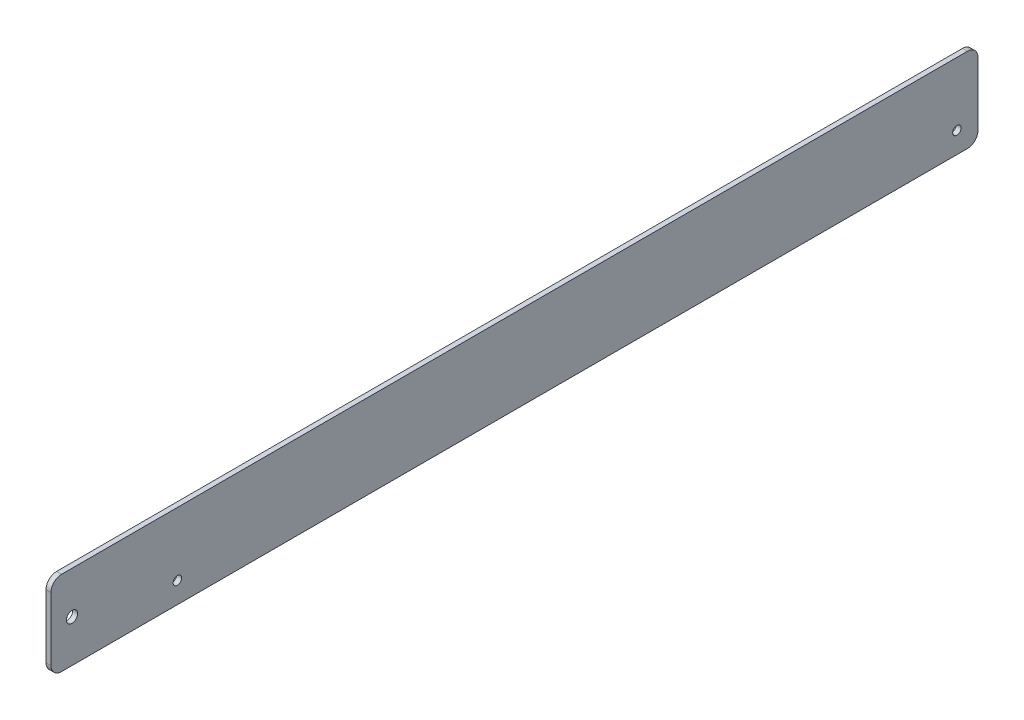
ISO-10303-21;
HEADER;
FILE_DESCRIPTION(('STEP AP214'),'2;1');
FILE_NAME('part.step','',(''),(''),'','','');
FILE_SCHEMA(('AUTOMOTIVE_DESIGN { 1 0 10303 214 1 1 1 1 }'));
ENDSEC;
DATA;
#1=APPLICATION_CONTEXT('core data for automotive mechanical design processes');
#2=APPLICATION_PROTOCOL_DEFINITION('international standard','automotive_design',2000,#1);
#3=PRODUCT_CONTEXT('',#1,'mechanical');
#4=PRODUCT('Part','Part','',(#3));
#5=PRODUCT_RELATED_PRODUCT_CATEGORY('part','',(#4));
#6=PRODUCT_DEFINITION_FORMATION('','',#4);
#7=PRODUCT_DEFINITION_CONTEXT('part definition',#1,'design');
#8=PRODUCT_DEFINITION('design','',#6,#7);
#9=PRODUCT_DEFINITION_SHAPE('','',#8);
#10=(LENGTH_UNIT() NAMED_UNIT(*) SI_UNIT(.MILLI.,.METRE.));
#11=(NAMED_UNIT(*) PLANE_ANGLE_UNIT() SI_UNIT($,.RADIAN.));
#12=(NAMED_UNIT(*) SI_UNIT($,.STERADIAN.) SOLID_ANGLE_UNIT());
#13=UNCERTAINTY_MEASURE_WITH_UNIT(LENGTH_MEASURE(1.E-05),#10,'distance_accuracy_value','');
#14=(GEOMETRIC_REPRESENTATION_CONTEXT(3) GLOBAL_UNCERTAINTY_ASSIGNED_CONTEXT((#13)) GLOBAL_UNIT_ASSIGNED_CONTEXT((#10,
#11,#12)) REPRESENTATION_CONTEXT('',''));
#15=CARTESIAN_POINT('',(0.,0.,0.));
#16=DIRECTION('',(0.,0.,1.));
#17=DIRECTION('',(1.,0.,0.));
#18=AXIS2_PLACEMENT_3D('',#15,#16,#17);
#19=CARTESIAN_POINT('',(2.9972,25.4,-279.4));
#20=DIRECTION('',(0.,0.,1.));
#21=DIRECTION('',(1.,0.,0.));
#22=AXIS2_PLACEMENT_3D('',#19,#20,#21);
#23=PLANE('',#22);
#24=DIRECTION('',(0.,1.,0.));
#25=VECTOR('',#24,1.);
#26=CARTESIAN_POINT('',(2.9972,25.4,-279.4));
#27=LINE('',#26,#25);
#28=CARTESIAN_POINT('',(2.9972,-19.05,-279.4));
#29=VERTEX_POINT('',#28);
#30=CARTESIAN_POINT('',(2.9972,19.05,-279.4));
#31=VERTEX_POINT('',#30);
#32=EDGE_CURVE('E234',#29,#31,#27,.T.);
#33=ORIENTED_EDGE('',*,*,#32,.F.);
#34=DIRECTION('',(-1.,0.,0.));
#35=VECTOR('',#34,1.);
#36=CARTESIAN_POINT('',(2.9972,-19.05,-279.4));
#37=LINE('',#36,#35);
#38=CARTESIAN_POINT('',(0.,-19.05,-279.4));
#39=VERTEX_POINT('',#38);
#40=EDGE_CURVE('E218',#29,#39,#37,.T.);
#41=ORIENTED_EDGE('',*,*,#40,.T.);
#42=DIRECTION('',(0.,1.,0.));
#43=VECTOR('',#42,1.);
#44=CARTESIAN_POINT('',(0.,25.4,-279.4));
#45=LINE('',#44,#43);
#46=CARTESIAN_POINT('',(0.,19.05,-279.4));
#47=VERTEX_POINT('',#46);
#48=EDGE_CURVE('E231',#39,#47,#45,.T.);
#49=ORIENTED_EDGE('',*,*,#48,.T.);
#50=DIRECTION('',(-1.,0.,0.));
#51=VECTOR('',#50,1.);
#52=CARTESIAN_POINT('',(2.9972,19.05,-279.4));
#53=LINE('',#52,#51);
#54=EDGE_CURVE('E237',#47,#31,#53,.F.);
#55=ORIENTED_EDGE('',*,*,#54,.T.);
#56=EDGE_LOOP('',(#33,#41,#49,#55));
#57=FACE_BOUND('',#56,.T.);
#58=ADVANCED_FACE('F148',(#57),#23,.F.);
#59=CARTESIAN_POINT('',(2.9972,25.4,279.4));
#60=DIRECTION('',(0.,-1.,0.));
#61=DIRECTION('',(0.,0.,-1.));
#62=AXIS2_PLACEMENT_3D('',#59,#60,#61);
#63=PLANE('',#62);
#64=DIRECTION('',(0.,0.,1.));
#65=VECTOR('',#64,1.);
#66=CARTESIAN_POINT('',(2.9972,25.4,279.4));
#67=LINE('',#66,#65);
#68=CARTESIAN_POINT('',(2.9972,25.4,-273.05));
#69=VERTEX_POINT('',#68);
#70=CARTESIAN_POINT('',(2.9972,25.4,273.05));
#71=VERTEX_POINT('',#70);
#72=EDGE_CURVE('E313',#69,#71,#67,.T.);
#73=ORIENTED_EDGE('',*,*,#72,.F.);
#74=DIRECTION('',(-1.,0.,0.));
#75=VECTOR('',#74,1.);
#76=CARTESIAN_POINT('',(2.9972,25.4,-273.05));
#77=LINE('',#76,#75);
#78=CARTESIAN_POINT('',(0.,25.4,-273.05));
#79=VERTEX_POINT('',#78);
#80=EDGE_CURVE('E291',#69,#79,#77,.T.);
#81=ORIENTED_EDGE('',*,*,#80,.T.);
#82=DIRECTION('',(0.,0.,1.));
#83=VECTOR('',#82,1.);
#84=CARTESIAN_POINT('',(0.,25.4,279.4));
#85=LINE('',#84,#83);
#86=CARTESIAN_POINT('',(0.,25.4,273.05));
#87=VERTEX_POINT('',#86);
#88=EDGE_CURVE('E242',#79,#87,#85,.T.);
#89=ORIENTED_EDGE('',*,*,#88,.T.);
#90=DIRECTION('',(-1.,0.,0.));
#91=VECTOR('',#90,1.);
#92=CARTESIAN_POINT('',(2.9972,25.4,273.05));
#93=LINE('',#92,#91);
#94=EDGE_CURVE('E288',#87,#71,#93,.F.);
#95=ORIENTED_EDGE('',*,*,#94,.T.);
#96=EDGE_LOOP('',(#73,#81,#89,#95));
#97=FACE_BOUND('',#96,.T.);
#98=ADVANCED_FACE('F366',(#97),#63,.F.);
#99=CARTESIAN_POINT('',(2.9972,25.4,279.4));
#100=DIRECTION('',(0.,0.,-1.));
#101=DIRECTION('',(-1.,0.,0.));
#102=AXIS2_PLACEMENT_3D('',#99,#100,#101);
#103=PLANE('',#102);
#104=DIRECTION('',(0.,-1.,0.));
#105=VECTOR('',#104,1.);
#106=CARTESIAN_POINT('',(0.,25.4,279.4));
#107=LINE('',#106,#105);
#108=CARTESIAN_POINT('',(0.,19.05,279.4));
#109=VERTEX_POINT('',#108);
#110=CARTESIAN_POINT('',(0.,-19.05,279.4));
#111=VERTEX_POINT('',#110);
#112=EDGE_CURVE('E249',#109,#111,#107,.T.);
#113=ORIENTED_EDGE('',*,*,#112,.T.);
#114=DIRECTION('',(-1.,0.,0.));
#115=VECTOR('',#114,1.);
#116=CARTESIAN_POINT('',(2.9972,-19.05,279.4));
#117=LINE('',#116,#115);
#118=CARTESIAN_POINT('',(2.9972,-19.05,279.4));
#119=VERTEX_POINT('',#118);
#120=EDGE_CURVE('E12',#111,#119,#117,.F.);
#121=ORIENTED_EDGE('',*,*,#120,.T.);
#122=DIRECTION('',(0.,-1.,0.));
#123=VECTOR('',#122,1.);
#124=CARTESIAN_POINT('',(2.9972,25.4,279.4));
#125=LINE('',#124,#123);
#126=CARTESIAN_POINT('',(2.9972,19.05,279.4));
#127=VERTEX_POINT('',#126);
#128=EDGE_CURVE('E300',#127,#119,#125,.T.);
#129=ORIENTED_EDGE('',*,*,#128,.F.);
#130=DIRECTION('',(-1.,0.,0.));
#131=VECTOR('',#130,1.);
#132=CARTESIAN_POINT('',(2.9972,19.05,279.4));
#133=LINE('',#132,#131);
#134=EDGE_CURVE('E157',#127,#109,#133,.T.);
#135=ORIENTED_EDGE('',*,*,#134,.T.);
#136=EDGE_LOOP('',(#113,#121,#129,#135));
#137=FACE_BOUND('',#136,.T.);
#138=ADVANCED_FACE('F299',(#137),#103,.F.);
#139=CARTESIAN_POINT('',(2.9972,-25.4,279.4));
#140=DIRECTION('',(0.,1.,0.));
#141=DIRECTION('',(0.,0.,1.));
#142=AXIS2_PLACEMENT_3D('',#139,#140,#141);
#143=PLANE('',#142);
#144=DIRECTION('',(0.,0.,-1.));
#145=VECTOR('',#144,1.);
#146=CARTESIAN_POINT('',(0.,-25.4,279.4));
#147=LINE('',#146,#145);
#148=CARTESIAN_POINT('',(0.,-25.4,273.05));
#149=VERTEX_POINT('',#148);
#150=CARTESIAN_POINT('',(0.,-25.4,-273.05));
#151=VERTEX_POINT('',#150);
#152=EDGE_CURVE('E260',#149,#151,#147,.T.);
#153=ORIENTED_EDGE('',*,*,#152,.T.);
#154=DIRECTION('',(-1.,0.,0.));
#155=VECTOR('',#154,1.);
#156=CARTESIAN_POINT('',(2.9972,-25.4,-273.05));
#157=LINE('',#156,#155);
#158=CARTESIAN_POINT('',(2.9972,-25.4,-273.05));
#159=VERTEX_POINT('',#158);
#160=EDGE_CURVE('E219',#151,#159,#157,.F.);
#161=ORIENTED_EDGE('',*,*,#160,.T.);
#162=DIRECTION('',(0.,0.,-1.));
#163=VECTOR('',#162,1.);
#164=CARTESIAN_POINT('',(2.9972,-25.4,279.4));
#165=LINE('',#164,#163);
#166=CARTESIAN_POINT('',(2.9972,-25.4,273.05));
#167=VERTEX_POINT('',#166);
#168=EDGE_CURVE('E255',#167,#159,#165,.T.);
#169=ORIENTED_EDGE('',*,*,#168,.F.);
#170=DIRECTION('',(-1.,0.,0.));
#171=VECTOR('',#170,1.);
#172=CARTESIAN_POINT('',(2.9972,-25.4,273.05));
#173=LINE('',#172,#171);
#174=EDGE_CURVE('E225',#167,#149,#173,.T.);
#175=ORIENTED_EDGE('',*,*,#174,.T.);
#176=EDGE_LOOP('',(#153,#161,#169,#175));
#177=FACE_BOUND('',#176,.T.);
#178=ADVANCED_FACE('F308',(#177),#143,.F.);
#179=CARTESIAN_POINT('',(2.9972,0.,0.));
#180=DIRECTION('',(1.,0.,0.));
#181=DIRECTION('',(0.,0.,-1.));
#182=AXIS2_PLACEMENT_3D('',#179,#180,#181);
#183=PLANE('',#182);
#184=CARTESIAN_POINT('',(2.9972,0.,266.7));
#185=DIRECTION('',(1.,0.,0.));
#186=DIRECTION('',(0.,0.,-1.));
#187=AXIS2_PLACEMENT_3D('',#184,#185,#186);
#188=CIRCLE('',#187,3.37350099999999);
#189=CARTESIAN_POINT('',(2.9972,0.,263.326499));
#190=VERTEX_POINT('',#189);
#191=EDGE_CURVE('E335',#190,#190,#188,.T.);
#192=ORIENTED_EDGE('',*,*,#191,.F.);
#193=EDGE_LOOP('',(#192));
#194=FACE_BOUND('',#193,.T.);
#195=CARTESIAN_POINT('',(2.9972,-12.7,203.2));
#196=DIRECTION('',(1.,0.,0.));
#197=DIRECTION('',(0.,0.,-1.));
#198=AXIS2_PLACEMENT_3D('',#195,#196,#197);
#199=CIRCLE('',#198,2.5527);
#200=CARTESIAN_POINT('',(2.9972,-12.7,200.6473));
#201=VERTEX_POINT('',#200);
#202=EDGE_CURVE('E327',#201,#201,#199,.T.);
#203=ORIENTED_EDGE('',*,*,#202,.F.);
#204=EDGE_LOOP('',(#203));
#205=FACE_BOUND('',#204,.T.);
#206=CARTESIAN_POINT('',(2.9972,-12.7,-266.7));
#207=DIRECTION('',(1.,0.,0.));
#208=DIRECTION('',(0.,0.,-1.));
#209=AXIS2_PLACEMENT_3D('',#206,#207,#208);
#210=CIRCLE('',#209,2.5527);
#211=CARTESIAN_POINT('',(2.9972,-12.7,-269.2527));
#212=VERTEX_POINT('',#211);
#213=EDGE_CURVE('E252',#212,#212,#210,.T.);
#214=ORIENTED_EDGE('',*,*,#213,.F.);
#215=EDGE_LOOP('',(#214));
#216=FACE_BOUND('',#215,.T.);
#217=ORIENTED_EDGE('',*,*,#168,.T.);
#218=CARTESIAN_POINT('',(2.9972,-19.05,-273.05));
#219=DIRECTION('',(1.,0.,0.));
#220=DIRECTION('',(0.,0.,-1.));
#221=AXIS2_PLACEMENT_3D('',#218,#219,#220);
#222=CIRCLE('',#221,6.35);
#223=EDGE_CURVE('E285',#159,#29,#222,.T.);
#224=ORIENTED_EDGE('',*,*,#223,.T.);
#225=ORIENTED_EDGE('',*,*,#32,.T.);
#226=CARTESIAN_POINT('',(2.9972,19.05,-273.05));
#227=DIRECTION('',(1.,0.,0.));
#228=DIRECTION('',(0.,0.,-1.));
#229=AXIS2_PLACEMENT_3D('',#226,#227,#228);
#230=CIRCLE('',#229,6.35);
#231=EDGE_CURVE('E282',#31,#69,#230,.T.);
#232=ORIENTED_EDGE('',*,*,#231,.T.);
#233=ORIENTED_EDGE('',*,*,#72,.T.);
#234=CARTESIAN_POINT('',(2.9972,19.05,273.05));
#235=DIRECTION('',(1.,0.,0.));
#236=DIRECTION('',(0.,0.,-1.));
#237=AXIS2_PLACEMENT_3D('',#234,#235,#236);
#238=CIRCLE('',#237,6.35);
#239=EDGE_CURVE('E169',#71,#127,#238,.T.);
#240=ORIENTED_EDGE('',*,*,#239,.T.);
#241=ORIENTED_EDGE('',*,*,#128,.T.);
#242=CARTESIAN_POINT('',(2.9972,-19.05,273.05));
#243=DIRECTION('',(1.,0.,0.));
#244=DIRECTION('',(0.,0.,-1.));
#245=AXIS2_PLACEMENT_3D('',#242,#243,#244);
#246=CIRCLE('',#245,6.35);
#247=EDGE_CURVE('E279',#119,#167,#246,.T.);
#248=ORIENTED_EDGE('',*,*,#247,.T.);
#249=EDGE_LOOP('',(#217,#224,#225,#232,#233,#240,#241,#248));
#250=FACE_BOUND('',#249,.T.);
#251=ADVANCED_FACE('F343',(#194,#205,#216,#250),#183,.T.);
#252=CARTESIAN_POINT('',(0.,0.,0.));
#253=DIRECTION('',(1.,0.,0.));
#254=DIRECTION('',(0.,0.,-1.));
#255=AXIS2_PLACEMENT_3D('',#252,#253,#254);
#256=PLANE('',#255);
#257=CARTESIAN_POINT('',(0.,0.,266.7));
#258=DIRECTION('',(1.,0.,0.));
#259=DIRECTION('',(0.,0.,-1.));
#260=AXIS2_PLACEMENT_3D('',#257,#258,#259);
#261=CIRCLE('',#260,3.37350099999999);
#262=CARTESIAN_POINT('',(0.,0.,263.326499));
#263=VERTEX_POINT('',#262);
#264=EDGE_CURVE('E331',#263,#263,#261,.T.);
#265=ORIENTED_EDGE('',*,*,#264,.T.);
#266=EDGE_LOOP('',(#265));
#267=FACE_BOUND('',#266,.T.);
#268=CARTESIAN_POINT('',(0.,-12.7,203.2));
#269=DIRECTION('',(1.,0.,0.));
#270=DIRECTION('',(0.,0.,-1.));
#271=AXIS2_PLACEMENT_3D('',#268,#269,#270);
#272=CIRCLE('',#271,2.55269999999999);
#273=CARTESIAN_POINT('',(0.,-12.7,200.6473));
#274=VERTEX_POINT('',#273);
#275=EDGE_CURVE('E323',#274,#274,#272,.T.);
#276=ORIENTED_EDGE('',*,*,#275,.T.);
#277=EDGE_LOOP('',(#276));
#278=FACE_BOUND('',#277,.T.);
#279=CARTESIAN_POINT('',(0.,-12.7,-266.7));
#280=DIRECTION('',(1.,0.,0.));
#281=DIRECTION('',(0.,0.,-1.));
#282=AXIS2_PLACEMENT_3D('',#279,#280,#281);
#283=CIRCLE('',#282,2.55269999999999);
#284=CARTESIAN_POINT('',(0.,-12.7,-269.2527));
#285=VERTEX_POINT('',#284);
#286=EDGE_CURVE('E243',#285,#285,#283,.T.);
#287=ORIENTED_EDGE('',*,*,#286,.T.);
#288=EDGE_LOOP('',(#287));
#289=FACE_BOUND('',#288,.T.);
#290=ORIENTED_EDGE('',*,*,#48,.F.);
#291=CARTESIAN_POINT('',(0.,-19.05,-273.05));
#292=DIRECTION('',(1.,0.,0.));
#293=DIRECTION('',(0.,0.,-1.));
#294=AXIS2_PLACEMENT_3D('',#291,#292,#293);
#295=CIRCLE('',#294,6.35);
#296=EDGE_CURVE('E214',#39,#151,#295,.F.);
#297=ORIENTED_EDGE('',*,*,#296,.T.);
#298=ORIENTED_EDGE('',*,*,#152,.F.);
#299=CARTESIAN_POINT('',(0.,-19.05,273.05));
#300=DIRECTION('',(1.,0.,0.));
#301=DIRECTION('',(0.,0.,-1.));
#302=AXIS2_PLACEMENT_3D('',#299,#300,#301);
#303=CIRCLE('',#302,6.35);
#304=EDGE_CURVE('E267',#149,#111,#303,.F.);
#305=ORIENTED_EDGE('',*,*,#304,.T.);
#306=ORIENTED_EDGE('',*,*,#112,.F.);
#307=CARTESIAN_POINT('',(0.,19.05,273.05));
#308=DIRECTION('',(1.,0.,0.));
#309=DIRECTION('',(0.,0.,-1.));
#310=AXIS2_PLACEMENT_3D('',#307,#308,#309);
#311=CIRCLE('',#310,6.35);
#312=EDGE_CURVE('E236',#109,#87,#311,.F.);
#313=ORIENTED_EDGE('',*,*,#312,.T.);
#314=ORIENTED_EDGE('',*,*,#88,.F.);
#315=CARTESIAN_POINT('',(0.,19.05,-273.05));
#316=DIRECTION('',(1.,0.,0.));
#317=DIRECTION('',(0.,0.,-1.));
#318=AXIS2_PLACEMENT_3D('',#315,#316,#317);
#319=CIRCLE('',#318,6.35);
#320=EDGE_CURVE('E226',#79,#47,#319,.F.);
#321=ORIENTED_EDGE('',*,*,#320,.T.);
#322=EDGE_LOOP('',(#290,#297,#298,#305,#306,#313,#314,#321));
#323=FACE_BOUND('',#322,.T.);
#324=ADVANCED_FACE('F239',(#267,#278,#289,#323),#256,.F.);
#325=CARTESIAN_POINT('',(2.9972,-12.7,-266.7));
#326=DIRECTION('',(1.,0.,0.));
#327=DIRECTION('',(0.,0.,-1.));
#328=AXIS2_PLACEMENT_3D('',#325,#326,#327);
#329=CYLINDRICAL_SURFACE('',#328,2.5527);
#330=ORIENTED_EDGE('',*,*,#286,.F.);
#331=EDGE_LOOP('',(#330));
#332=FACE_BOUND('',#331,.T.);
#333=ORIENTED_EDGE('',*,*,#213,.T.);
#334=EDGE_LOOP('',(#333));
#335=FACE_BOUND('',#334,.T.);
#336=ADVANCED_FACE('F351',(#332,#335),#329,.F.);
#337=CARTESIAN_POINT('',(2.9972,-12.7,203.2));
#338=DIRECTION('',(1.,0.,0.));
#339=DIRECTION('',(0.,0.,-1.));
#340=AXIS2_PLACEMENT_3D('',#337,#338,#339);
#341=CYLINDRICAL_SURFACE('',#340,2.5527);
#342=ORIENTED_EDGE('',*,*,#275,.F.);
#343=EDGE_LOOP('',(#342));
#344=FACE_BOUND('',#343,.T.);
#345=ORIENTED_EDGE('',*,*,#202,.T.);
#346=EDGE_LOOP('',(#345));
#347=FACE_BOUND('',#346,.T.);
#348=ADVANCED_FACE('F353',(#344,#347),#341,.F.);
#349=CARTESIAN_POINT('',(2.9972,0.,266.7));
#350=DIRECTION('',(1.,0.,0.));
#351=DIRECTION('',(0.,0.,-1.));
#352=AXIS2_PLACEMENT_3D('',#349,#350,#351);
#353=CYLINDRICAL_SURFACE('',#352,3.37350099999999);
#354=ORIENTED_EDGE('',*,*,#264,.F.);
#355=EDGE_LOOP('',(#354));
#356=FACE_BOUND('',#355,.T.);
#357=ORIENTED_EDGE('',*,*,#191,.T.);
#358=EDGE_LOOP('',(#357));
#359=FACE_BOUND('',#358,.T.);
#360=ADVANCED_FACE('F341',(#356,#359),#353,.F.);
#361=CARTESIAN_POINT('',(2.9972,-19.05,-273.05));
#362=DIRECTION('',(-1.,0.,0.));
#363=DIRECTION('',(0.,0.,1.));
#364=AXIS2_PLACEMENT_3D('',#361,#362,#363);
#365=CYLINDRICAL_SURFACE('',#364,6.35);
#366=ORIENTED_EDGE('',*,*,#223,.F.);
#367=ORIENTED_EDGE('',*,*,#160,.F.);
#368=ORIENTED_EDGE('',*,*,#296,.F.);
#369=ORIENTED_EDGE('',*,*,#40,.F.);
#370=EDGE_LOOP('',(#366,#367,#368,#369));
#371=FACE_BOUND('',#370,.T.);
#372=ADVANCED_FACE('F217',(#371),#365,.T.);
#373=CARTESIAN_POINT('',(2.9972,19.05,-273.05));
#374=DIRECTION('',(-1.,0.,0.));
#375=DIRECTION('',(0.,0.,1.));
#376=AXIS2_PLACEMENT_3D('',#373,#374,#375);
#377=CYLINDRICAL_SURFACE('',#376,6.35);
#378=ORIENTED_EDGE('',*,*,#231,.F.);
#379=ORIENTED_EDGE('',*,*,#54,.F.);
#380=ORIENTED_EDGE('',*,*,#320,.F.);
#381=ORIENTED_EDGE('',*,*,#80,.F.);
#382=EDGE_LOOP('',(#378,#379,#380,#381));
#383=FACE_BOUND('',#382,.T.);
#384=ADVANCED_FACE('F377',(#383),#377,.T.);
#385=CARTESIAN_POINT('',(2.9972,-19.05,273.05));
#386=DIRECTION('',(-1.,0.,0.));
#387=DIRECTION('',(0.,0.,1.));
#388=AXIS2_PLACEMENT_3D('',#385,#386,#387);
#389=CYLINDRICAL_SURFACE('',#388,6.35);
#390=ORIENTED_EDGE('',*,*,#247,.F.);
#391=ORIENTED_EDGE('',*,*,#120,.F.);
#392=ORIENTED_EDGE('',*,*,#304,.F.);
#393=ORIENTED_EDGE('',*,*,#174,.F.);
#394=EDGE_LOOP('',(#390,#391,#392,#393));
#395=FACE_BOUND('',#394,.T.);
#396=ADVANCED_FACE('F305',(#395),#389,.T.);
#397=CARTESIAN_POINT('',(2.9972,19.05,273.05));
#398=DIRECTION('',(-1.,0.,0.));
#399=DIRECTION('',(0.,0.,1.));
#400=AXIS2_PLACEMENT_3D('',#397,#398,#399);
#401=CYLINDRICAL_SURFACE('',#400,6.35);
#402=ORIENTED_EDGE('',*,*,#239,.F.);
#403=ORIENTED_EDGE('',*,*,#94,.F.);
#404=ORIENTED_EDGE('',*,*,#312,.F.);
#405=ORIENTED_EDGE('',*,*,#134,.F.);
#406=EDGE_LOOP('',(#402,#403,#404,#405));
#407=FACE_BOUND('',#406,.T.);
#408=ADVANCED_FACE('F150',(#407),#401,.T.);
#409=CLOSED_SHELL('',(#58,#98,#138,#178,#251,#324,#336,#348,#360,#372,#384,#396,#408));
#410=MANIFOLD_SOLID_BREP('B2',#409);
#411=ADVANCED_BREP_SHAPE_REPRESENTATION('',(#18,#410),#14);
#412=SHAPE_DEFINITION_REPRESENTATION(#9,#411);
ENDSEC;
END-ISO-10303-21;
